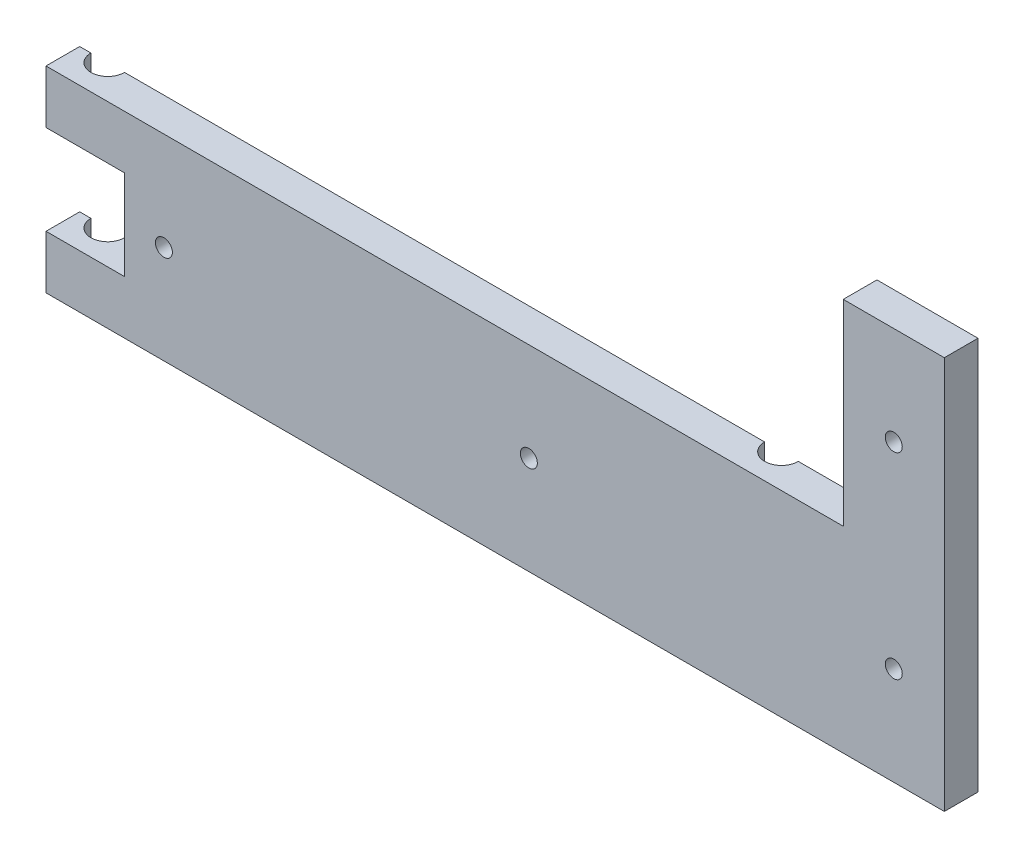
ISO-10303-21;
HEADER;
FILE_DESCRIPTION(('STEP AP214'),'2;1');
FILE_NAME('part.step','',(''),(''),'','','');
FILE_SCHEMA(('AUTOMOTIVE_DESIGN { 1 0 10303 214 1 1 1 1 }'));
ENDSEC;
DATA;
#1=APPLICATION_CONTEXT('core data for automotive mechanical design processes');
#2=APPLICATION_PROTOCOL_DEFINITION('international standard','automotive_design',2000,#1);
#3=PRODUCT_CONTEXT('',#1,'mechanical');
#4=PRODUCT('Part','Part','',(#3));
#5=PRODUCT_RELATED_PRODUCT_CATEGORY('part','',(#4));
#6=PRODUCT_DEFINITION_FORMATION('','',#4);
#7=PRODUCT_DEFINITION_CONTEXT('part definition',#1,'design');
#8=PRODUCT_DEFINITION('design','',#6,#7);
#9=PRODUCT_DEFINITION_SHAPE('','',#8);
#10=(LENGTH_UNIT() NAMED_UNIT(*) SI_UNIT(.MILLI.,.METRE.));
#11=(NAMED_UNIT(*) PLANE_ANGLE_UNIT() SI_UNIT($,.RADIAN.));
#12=(NAMED_UNIT(*) SI_UNIT($,.STERADIAN.) SOLID_ANGLE_UNIT());
#13=UNCERTAINTY_MEASURE_WITH_UNIT(LENGTH_MEASURE(1.E-05),#10,'distance_accuracy_value','');
#14=(GEOMETRIC_REPRESENTATION_CONTEXT(3) GLOBAL_UNCERTAINTY_ASSIGNED_CONTEXT((#13)) GLOBAL_UNIT_ASSIGNED_CONTEXT((#10,
#11,#12)) REPRESENTATION_CONTEXT('',''));
#15=CARTESIAN_POINT('',(0.,0.,0.));
#16=DIRECTION('',(0.,0.,1.));
#17=DIRECTION('',(1.,0.,0.));
#18=AXIS2_PLACEMENT_3D('',#15,#16,#17);
#19=CARTESIAN_POINT('',(155.,35.,0.));
#20=DIRECTION('',(0.,0.,1.));
#21=DIRECTION('',(1.,0.,0.));
#22=AXIS2_PLACEMENT_3D('',#19,#20,#21);
#23=PLANE('',#22);
#24=CARTESIAN_POINT('',(16.,17.4999999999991,0.));
#25=DIRECTION('',(0.,0.,1.));
#26=DIRECTION('',(1.,0.,0.));
#27=AXIS2_PLACEMENT_3D('',#24,#25,#26);
#28=CIRCLE('',#27,1.51000000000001);
#29=CARTESIAN_POINT('',(17.51,17.4999999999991,0.));
#30=VERTEX_POINT('',#29);
#31=EDGE_CURVE('E292',#30,#30,#28,.T.);
#32=ORIENTED_EDGE('',*,*,#31,.T.);
#33=EDGE_LOOP('',(#32));
#34=FACE_BOUND('',#33,.T.);
#35=CARTESIAN_POINT('',(81.,17.4999999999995,0.));
#36=DIRECTION('',(0.,0.,1.));
#37=DIRECTION('',(1.,0.,0.));
#38=AXIS2_PLACEMENT_3D('',#35,#36,#37);
#39=CIRCLE('',#38,1.51000000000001);
#40=CARTESIAN_POINT('',(82.51,17.4999999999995,0.));
#41=VERTEX_POINT('',#40);
#42=EDGE_CURVE('E298',#41,#41,#39,.T.);
#43=ORIENTED_EDGE('',*,*,#42,.T.);
#44=EDGE_LOOP('',(#43));
#45=FACE_BOUND('',#44,.T.);
#46=DIRECTION('',(-1.,0.,0.));
#47=VECTOR('',#46,1.);
#48=CARTESIAN_POINT('',(137.,35.,0.));
#49=LINE('',#48,#47);
#50=CARTESIAN_POINT('',(117.,35.,0.));
#51=VERTEX_POINT('',#50);
#52=CARTESIAN_POINT('',(3.,35.,0.));
#53=VERTEX_POINT('',#52);
#54=EDGE_CURVE('E157',#51,#53,#49,.T.);
#55=ORIENTED_EDGE('',*,*,#54,.F.);
#56=DIRECTION('',(0.,-1.,0.));
#57=VECTOR('',#56,1.);
#58=CARTESIAN_POINT('',(117.,70.,0.));
#59=LINE('',#58,#57);
#60=CARTESIAN_POINT('',(117.,0.,0.));
#61=VERTEX_POINT('',#60);
#62=EDGE_CURVE('E145',#51,#61,#59,.T.);
#63=ORIENTED_EDGE('',*,*,#62,.T.);
#64=DIRECTION('',(1.,0.,0.));
#65=VECTOR('',#64,1.);
#66=CARTESIAN_POINT('',(-4.99999999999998,0.,0.));
#67=LINE('',#66,#65);
#68=CARTESIAN_POINT('',(3.,0.,0.));
#69=VERTEX_POINT('',#68);
#70=EDGE_CURVE('E156',#69,#61,#67,.T.);
#71=ORIENTED_EDGE('',*,*,#70,.F.);
#72=DIRECTION('',(0.,-1.,0.));
#73=VECTOR('',#72,1.);
#74=CARTESIAN_POINT('',(3.,70.,0.));
#75=LINE('',#74,#73);
#76=CARTESIAN_POINT('',(3.,9.50000000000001,0.));
#77=VERTEX_POINT('',#76);
#78=EDGE_CURVE('E278',#69,#77,#75,.F.);
#79=ORIENTED_EDGE('',*,*,#78,.T.);
#80=DIRECTION('',(-1.,0.,0.));
#81=VECTOR('',#80,1.);
#82=CARTESIAN_POINT('',(9.,9.50000000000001,0.));
#83=LINE('',#82,#81);
#84=CARTESIAN_POINT('',(9.,9.50000000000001,0.));
#85=VERTEX_POINT('',#84);
#86=EDGE_CURVE('E246',#85,#77,#83,.T.);
#87=ORIENTED_EDGE('',*,*,#86,.F.);
#88=DIRECTION('',(0.,-1.,0.));
#89=VECTOR('',#88,1.);
#90=CARTESIAN_POINT('',(8.99999999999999,25.5,0.));
#91=LINE('',#90,#89);
#92=CARTESIAN_POINT('',(8.99999999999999,25.5,0.));
#93=VERTEX_POINT('',#92);
#94=EDGE_CURVE('E244',#93,#85,#91,.T.);
#95=ORIENTED_EDGE('',*,*,#94,.F.);
#96=DIRECTION('',(1.,0.,0.));
#97=VECTOR('',#96,1.);
#98=CARTESIAN_POINT('',(-4.99999999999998,25.5,0.));
#99=LINE('',#98,#97);
#100=CARTESIAN_POINT('',(3.,25.5,0.));
#101=VERTEX_POINT('',#100);
#102=EDGE_CURVE('E240',#101,#93,#99,.T.);
#103=ORIENTED_EDGE('',*,*,#102,.F.);
#104=EDGE_CURVE('E54',#101,#53,#75,.F.);
#105=ORIENTED_EDGE('',*,*,#104,.T.);
#106=EDGE_LOOP('',(#55,#63,#71,#79,#87,#95,#103,#105));
#107=FACE_BOUND('',#106,.T.);
#108=ADVANCED_FACE('F31',(#34,#45,#107),#23,.F.);
#109=CARTESIAN_POINT('',(-3.,9.50000000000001,0.));
#110=VERTEX_POINT('',#109);
#111=CARTESIAN_POINT('',(-4.99999999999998,9.5,0.));
#112=VERTEX_POINT('',#111);
#113=EDGE_CURVE('E245',#110,#112,#83,.T.);
#114=ORIENTED_EDGE('',*,*,#113,.F.);
#115=DIRECTION('',(0.,-1.,0.));
#116=VECTOR('',#115,1.);
#117=CARTESIAN_POINT('',(-3.,70.,0.));
#118=LINE('',#117,#116);
#119=CARTESIAN_POINT('',(-3.,0.,0.));
#120=VERTEX_POINT('',#119);
#121=EDGE_CURVE('E265',#110,#120,#118,.T.);
#122=ORIENTED_EDGE('',*,*,#121,.T.);
#123=CARTESIAN_POINT('',(-4.99999999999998,0.,0.));
#124=VERTEX_POINT('',#123);
#125=EDGE_CURVE('E163',#124,#120,#67,.T.);
#126=ORIENTED_EDGE('',*,*,#125,.F.);
#127=DIRECTION('',(0.,-1.,0.));
#128=VECTOR('',#127,1.);
#129=CARTESIAN_POINT('',(-4.99999999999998,9.5,0.));
#130=LINE('',#129,#128);
#131=EDGE_CURVE('E167',#112,#124,#130,.T.);
#132=ORIENTED_EDGE('',*,*,#131,.F.);
#133=EDGE_LOOP('',(#114,#122,#126,#132));
#134=FACE_BOUND('',#133,.T.);
#135=ADVANCED_FACE('F264',(#134),#23,.F.);
#136=CARTESIAN_POINT('',(-3.,35.,0.));
#137=VERTEX_POINT('',#136);
#138=CARTESIAN_POINT('',(-4.99999999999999,35.,0.));
#139=VERTEX_POINT('',#138);
#140=EDGE_CURVE('E231',#137,#139,#49,.T.);
#141=ORIENTED_EDGE('',*,*,#140,.F.);
#142=CARTESIAN_POINT('',(-3.,25.5,0.));
#143=VERTEX_POINT('',#142);
#144=EDGE_CURVE('E283',#137,#143,#118,.T.);
#145=ORIENTED_EDGE('',*,*,#144,.T.);
#146=CARTESIAN_POINT('',(-4.99999999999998,25.5,0.));
#147=VERTEX_POINT('',#146);
#148=EDGE_CURVE('E241',#147,#143,#99,.T.);
#149=ORIENTED_EDGE('',*,*,#148,.F.);
#150=DIRECTION('',(0.,-1.,0.));
#151=VECTOR('',#150,1.);
#152=CARTESIAN_POINT('',(-4.99999999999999,35.,0.));
#153=LINE('',#152,#151);
#154=EDGE_CURVE('E238',#139,#147,#153,.T.);
#155=ORIENTED_EDGE('',*,*,#154,.F.);
#156=EDGE_LOOP('',(#141,#145,#149,#155));
#157=FACE_BOUND('',#156,.T.);
#158=ADVANCED_FACE('F338',(#157),#23,.F.);
#159=CARTESIAN_POINT('',(155.,35.,6.));
#160=DIRECTION('',(0.,0.,1.));
#161=DIRECTION('',(1.,0.,0.));
#162=AXIS2_PLACEMENT_3D('',#159,#160,#161);
#163=PLANE('',#162);
#164=CARTESIAN_POINT('',(81.,17.4999999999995,6.));
#165=DIRECTION('',(0.,0.,1.));
#166=DIRECTION('',(1.,0.,0.));
#167=AXIS2_PLACEMENT_3D('',#164,#165,#166);
#168=CIRCLE('',#167,1.51000000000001);
#169=CARTESIAN_POINT('',(82.51,17.4999999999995,6.));
#170=VERTEX_POINT('',#169);
#171=EDGE_CURVE('E301',#170,#170,#168,.T.);
#172=ORIENTED_EDGE('',*,*,#171,.F.);
#173=EDGE_LOOP('',(#172));
#174=FACE_BOUND('',#173,.T.);
#175=CARTESIAN_POINT('',(146.,17.5,6.));
#176=DIRECTION('',(0.,0.,1.));
#177=DIRECTION('',(1.,0.,0.));
#178=AXIS2_PLACEMENT_3D('',#175,#176,#177);
#179=CIRCLE('',#178,1.51000000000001);
#180=CARTESIAN_POINT('',(147.51,17.5,6.));
#181=VERTEX_POINT('',#180);
#182=EDGE_CURVE('E313',#181,#181,#179,.T.);
#183=ORIENTED_EDGE('',*,*,#182,.F.);
#184=EDGE_LOOP('',(#183));
#185=FACE_BOUND('',#184,.T.);
#186=DIRECTION('',(0.,1.,0.));
#187=VECTOR('',#186,1.);
#188=CARTESIAN_POINT('',(155.,0.,6.));
#189=LINE('',#188,#187);
#190=CARTESIAN_POINT('',(155.,0.,6.));
#191=VERTEX_POINT('',#190);
#192=CARTESIAN_POINT('',(155.,70.,6.));
#193=VERTEX_POINT('',#192);
#194=EDGE_CURVE('E166',#191,#193,#189,.T.);
#195=ORIENTED_EDGE('',*,*,#194,.T.);
#196=DIRECTION('',(-1.,0.,0.));
#197=VECTOR('',#196,1.);
#198=CARTESIAN_POINT('',(155.,70.,6.));
#199=LINE('',#198,#197);
#200=CARTESIAN_POINT('',(137.,70.,6.));
#201=VERTEX_POINT('',#200);
#202=EDGE_CURVE('E173',#193,#201,#199,.T.);
#203=ORIENTED_EDGE('',*,*,#202,.T.);
#204=DIRECTION('',(0.,-1.,0.));
#205=VECTOR('',#204,1.);
#206=CARTESIAN_POINT('',(137.,70.,6.));
#207=LINE('',#206,#205);
#208=CARTESIAN_POINT('',(137.,35.,6.));
#209=VERTEX_POINT('',#208);
#210=EDGE_CURVE('E175',#201,#209,#207,.T.);
#211=ORIENTED_EDGE('',*,*,#210,.T.);
#212=DIRECTION('',(-1.,0.,0.));
#213=VECTOR('',#212,1.);
#214=CARTESIAN_POINT('',(137.,35.,6.));
#215=LINE('',#214,#213);
#216=CARTESIAN_POINT('',(-4.99999999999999,35.,6.));
#217=VERTEX_POINT('',#216);
#218=EDGE_CURVE('E177',#209,#217,#215,.T.);
#219=ORIENTED_EDGE('',*,*,#218,.T.);
#220=DIRECTION('',(0.,-1.,0.));
#221=VECTOR('',#220,1.);
#222=CARTESIAN_POINT('',(-4.99999999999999,35.,6.));
#223=LINE('',#222,#221);
#224=CARTESIAN_POINT('',(-4.99999999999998,25.5,6.));
#225=VERTEX_POINT('',#224);
#226=EDGE_CURVE('E179',#217,#225,#223,.T.);
#227=ORIENTED_EDGE('',*,*,#226,.T.);
#228=DIRECTION('',(1.,0.,0.));
#229=VECTOR('',#228,1.);
#230=CARTESIAN_POINT('',(-4.99999999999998,25.5,6.));
#231=LINE('',#230,#229);
#232=CARTESIAN_POINT('',(8.99999999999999,25.5,6.));
#233=VERTEX_POINT('',#232);
#234=EDGE_CURVE('E181',#225,#233,#231,.T.);
#235=ORIENTED_EDGE('',*,*,#234,.T.);
#236=DIRECTION('',(0.,-1.,0.));
#237=VECTOR('',#236,1.);
#238=CARTESIAN_POINT('',(8.99999999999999,25.5,6.));
#239=LINE('',#238,#237);
#240=CARTESIAN_POINT('',(9.,9.50000000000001,6.));
#241=VERTEX_POINT('',#240);
#242=EDGE_CURVE('E183',#233,#241,#239,.T.);
#243=ORIENTED_EDGE('',*,*,#242,.T.);
#244=DIRECTION('',(-1.,0.,0.));
#245=VECTOR('',#244,1.);
#246=CARTESIAN_POINT('',(9.,9.50000000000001,6.));
#247=LINE('',#246,#245);
#248=CARTESIAN_POINT('',(-4.99999999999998,9.5,6.));
#249=VERTEX_POINT('',#248);
#250=EDGE_CURVE('E185',#241,#249,#247,.T.);
#251=ORIENTED_EDGE('',*,*,#250,.T.);
#252=DIRECTION('',(0.,-1.,0.));
#253=VECTOR('',#252,1.);
#254=CARTESIAN_POINT('',(-4.99999999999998,9.5,6.));
#255=LINE('',#254,#253);
#256=CARTESIAN_POINT('',(-4.99999999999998,0.,6.));
#257=VERTEX_POINT('',#256);
#258=EDGE_CURVE('E187',#249,#257,#255,.T.);
#259=ORIENTED_EDGE('',*,*,#258,.T.);
#260=DIRECTION('',(1.,0.,0.));
#261=VECTOR('',#260,1.);
#262=CARTESIAN_POINT('',(-4.99999999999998,0.,6.));
#263=LINE('',#262,#261);
#264=EDGE_CURVE('E189',#257,#191,#263,.T.);
#265=ORIENTED_EDGE('',*,*,#264,.T.);
#266=EDGE_LOOP('',(#195,#203,#211,#219,#227,#235,#243,#251,#259,#265));
#267=FACE_BOUND('',#266,.T.);
#268=CARTESIAN_POINT('',(146.,52.5,6.));
#269=DIRECTION('',(0.,0.,1.));
#270=DIRECTION('',(1.,0.,0.));
#271=AXIS2_PLACEMENT_3D('',#268,#269,#270);
#272=CIRCLE('',#271,1.51000000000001);
#273=CARTESIAN_POINT('',(147.51,52.5,6.));
#274=VERTEX_POINT('',#273);
#275=EDGE_CURVE('E307',#274,#274,#272,.T.);
#276=ORIENTED_EDGE('',*,*,#275,.F.);
#277=EDGE_LOOP('',(#276));
#278=FACE_BOUND('',#277,.T.);
#279=CARTESIAN_POINT('',(16.,17.4999999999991,6.));
#280=DIRECTION('',(0.,0.,1.));
#281=DIRECTION('',(1.,0.,0.));
#282=AXIS2_PLACEMENT_3D('',#279,#280,#281);
#283=CIRCLE('',#282,1.51000000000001);
#284=CARTESIAN_POINT('',(17.51,17.4999999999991,6.));
#285=VERTEX_POINT('',#284);
#286=EDGE_CURVE('E295',#285,#285,#283,.T.);
#287=ORIENTED_EDGE('',*,*,#286,.F.);
#288=EDGE_LOOP('',(#287));
#289=FACE_BOUND('',#288,.T.);
#290=ADVANCED_FACE('F270',(#174,#185,#267,#278,#289),#163,.T.);
#291=CARTESIAN_POINT('',(146.,17.5,0.));
#292=DIRECTION('',(0.,0.,1.));
#293=DIRECTION('',(1.,0.,0.));
#294=AXIS2_PLACEMENT_3D('',#291,#292,#293);
#295=CIRCLE('',#294,1.51000000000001);
#296=CARTESIAN_POINT('',(147.51,17.5,0.));
#297=VERTEX_POINT('',#296);
#298=EDGE_CURVE('E310',#297,#297,#295,.T.);
#299=ORIENTED_EDGE('',*,*,#298,.T.);
#300=EDGE_LOOP('',(#299));
#301=FACE_BOUND('',#300,.T.);
#302=CARTESIAN_POINT('',(123.,0.,0.));
#303=VERTEX_POINT('',#302);
#304=CARTESIAN_POINT('',(155.,0.,0.));
#305=VERTEX_POINT('',#304);
#306=EDGE_CURVE('E164',#303,#305,#67,.T.);
#307=ORIENTED_EDGE('',*,*,#306,.F.);
#308=DIRECTION('',(0.,-1.,0.));
#309=VECTOR('',#308,1.);
#310=CARTESIAN_POINT('',(123.,70.,0.));
#311=LINE('',#310,#309);
#312=CARTESIAN_POINT('',(123.,35.,0.));
#313=VERTEX_POINT('',#312);
#314=EDGE_CURVE('E46',#303,#313,#311,.F.);
#315=ORIENTED_EDGE('',*,*,#314,.T.);
#316=CARTESIAN_POINT('',(137.,35.,0.));
#317=VERTEX_POINT('',#316);
#318=EDGE_CURVE('E230',#317,#313,#49,.T.);
#319=ORIENTED_EDGE('',*,*,#318,.F.);
#320=DIRECTION('',(0.,-1.,0.));
#321=VECTOR('',#320,1.);
#322=CARTESIAN_POINT('',(137.,70.,0.));
#323=LINE('',#322,#321);
#324=CARTESIAN_POINT('',(137.,70.,0.));
#325=VERTEX_POINT('',#324);
#326=EDGE_CURVE('E221',#325,#317,#323,.T.);
#327=ORIENTED_EDGE('',*,*,#326,.F.);
#328=DIRECTION('',(-1.,0.,0.));
#329=VECTOR('',#328,1.);
#330=CARTESIAN_POINT('',(155.,70.,0.));
#331=LINE('',#330,#329);
#332=CARTESIAN_POINT('',(155.,70.,0.));
#333=VERTEX_POINT('',#332);
#334=EDGE_CURVE('E228',#333,#325,#331,.T.);
#335=ORIENTED_EDGE('',*,*,#334,.F.);
#336=DIRECTION('',(0.,1.,0.));
#337=VECTOR('',#336,1.);
#338=CARTESIAN_POINT('',(155.,0.,0.));
#339=LINE('',#338,#337);
#340=EDGE_CURVE('E234',#305,#333,#339,.T.);
#341=ORIENTED_EDGE('',*,*,#340,.F.);
#342=EDGE_LOOP('',(#307,#315,#319,#327,#335,#341));
#343=FACE_BOUND('',#342,.T.);
#344=CARTESIAN_POINT('',(146.,52.5,0.));
#345=DIRECTION('',(0.,0.,1.));
#346=DIRECTION('',(1.,0.,0.));
#347=AXIS2_PLACEMENT_3D('',#344,#345,#346);
#348=CIRCLE('',#347,1.51000000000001);
#349=CARTESIAN_POINT('',(147.51,52.5,0.));
#350=VERTEX_POINT('',#349);
#351=EDGE_CURVE('E304',#350,#350,#348,.T.);
#352=ORIENTED_EDGE('',*,*,#351,.T.);
#353=EDGE_LOOP('',(#352));
#354=FACE_BOUND('',#353,.T.);
#355=ADVANCED_FACE('F225',(#301,#343,#354),#23,.F.);
#356=CARTESIAN_POINT('',(155.,0.,6.));
#357=DIRECTION('',(-1.,0.,0.));
#358=DIRECTION('',(0.,-1.,0.));
#359=AXIS2_PLACEMENT_3D('',#356,#357,#358);
#360=PLANE('',#359);
#361=ORIENTED_EDGE('',*,*,#340,.T.);
#362=DIRECTION('',(0.,0.,-1.));
#363=VECTOR('',#362,1.);
#364=CARTESIAN_POINT('',(155.,70.,6.));
#365=LINE('',#364,#363);
#366=EDGE_CURVE('E11',#193,#333,#365,.T.);
#367=ORIENTED_EDGE('',*,*,#366,.F.);
#368=ORIENTED_EDGE('',*,*,#194,.F.);
#369=DIRECTION('',(0.,0.,-1.));
#370=VECTOR('',#369,1.);
#371=CARTESIAN_POINT('',(155.,0.,6.));
#372=LINE('',#371,#370);
#373=EDGE_CURVE('E191',#191,#305,#372,.T.);
#374=ORIENTED_EDGE('',*,*,#373,.T.);
#375=EDGE_LOOP('',(#361,#367,#368,#374));
#376=FACE_BOUND('',#375,.T.);
#377=ADVANCED_FACE('F33',(#376),#360,.F.);
#378=CARTESIAN_POINT('',(155.,70.,6.));
#379=DIRECTION('',(0.,-1.,0.));
#380=DIRECTION('',(0.,0.,-1.));
#381=AXIS2_PLACEMENT_3D('',#378,#379,#380);
#382=PLANE('',#381);
#383=ORIENTED_EDGE('',*,*,#334,.T.);
#384=DIRECTION('',(0.,0.,-1.));
#385=VECTOR('',#384,1.);
#386=CARTESIAN_POINT('',(137.,70.,6.));
#387=LINE('',#386,#385);
#388=EDGE_CURVE('E39',#201,#325,#387,.T.);
#389=ORIENTED_EDGE('',*,*,#388,.F.);
#390=ORIENTED_EDGE('',*,*,#202,.F.);
#391=ORIENTED_EDGE('',*,*,#366,.T.);
#392=EDGE_LOOP('',(#383,#389,#390,#391));
#393=FACE_BOUND('',#392,.T.);
#394=ADVANCED_FACE('F324',(#393),#382,.F.);
#395=CARTESIAN_POINT('',(137.,70.,6.));
#396=DIRECTION('',(1.,0.,0.));
#397=DIRECTION('',(0.,1.,0.));
#398=AXIS2_PLACEMENT_3D('',#395,#396,#397);
#399=PLANE('',#398);
#400=ORIENTED_EDGE('',*,*,#326,.T.);
#401=DIRECTION('',(0.,0.,-1.));
#402=VECTOR('',#401,1.);
#403=CARTESIAN_POINT('',(137.,35.,6.));
#404=LINE('',#403,#402);
#405=EDGE_CURVE('E212',#209,#317,#404,.T.);
#406=ORIENTED_EDGE('',*,*,#405,.F.);
#407=ORIENTED_EDGE('',*,*,#210,.F.);
#408=ORIENTED_EDGE('',*,*,#388,.T.);
#409=EDGE_LOOP('',(#400,#406,#407,#408));
#410=FACE_BOUND('',#409,.T.);
#411=ADVANCED_FACE('F219',(#410),#399,.F.);
#412=CARTESIAN_POINT('',(137.,35.,6.));
#413=DIRECTION('',(0.,-1.,0.));
#414=DIRECTION('',(1.,0.,0.));
#415=AXIS2_PLACEMENT_3D('',#412,#413,#414);
#416=PLANE('',#415);
#417=ORIENTED_EDGE('',*,*,#318,.T.);
#418=CARTESIAN_POINT('',(120.,35.,0.));
#419=DIRECTION('',(0.,-1.,0.));
#420=DIRECTION('',(1.,0.,0.));
#421=AXIS2_PLACEMENT_3D('',#418,#419,#420);
#422=CIRCLE('',#421,3.00000000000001);
#423=EDGE_CURVE('E150',#313,#51,#422,.T.);
#424=ORIENTED_EDGE('',*,*,#423,.T.);
#425=ORIENTED_EDGE('',*,*,#54,.T.);
#426=CARTESIAN_POINT('',(0.,35.,0.));
#427=DIRECTION('',(0.,-1.,0.));
#428=DIRECTION('',(1.,0.,0.));
#429=AXIS2_PLACEMENT_3D('',#426,#427,#428);
#430=CIRCLE('',#429,3.);
#431=EDGE_CURVE('E286',#53,#137,#430,.T.);
#432=ORIENTED_EDGE('',*,*,#431,.T.);
#433=ORIENTED_EDGE('',*,*,#140,.T.);
#434=DIRECTION('',(0.,0.,-1.));
#435=VECTOR('',#434,1.);
#436=CARTESIAN_POINT('',(-4.99999999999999,35.,6.));
#437=LINE('',#436,#435);
#438=EDGE_CURVE('E209',#217,#139,#437,.T.);
#439=ORIENTED_EDGE('',*,*,#438,.F.);
#440=ORIENTED_EDGE('',*,*,#218,.F.);
#441=ORIENTED_EDGE('',*,*,#405,.T.);
#442=EDGE_LOOP('',(#417,#424,#425,#432,#433,#439,#440,#441));
#443=FACE_BOUND('',#442,.T.);
#444=ADVANCED_FACE('F319',(#443),#416,.F.);
#445=CARTESIAN_POINT('',(-4.99999999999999,35.,6.));
#446=DIRECTION('',(1.,0.,0.));
#447=DIRECTION('',(0.,1.,0.));
#448=AXIS2_PLACEMENT_3D('',#445,#446,#447);
#449=PLANE('',#448);
#450=ORIENTED_EDGE('',*,*,#154,.T.);
#451=DIRECTION('',(0.,0.,-1.));
#452=VECTOR('',#451,1.);
#453=CARTESIAN_POINT('',(-4.99999999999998,25.5,6.));
#454=LINE('',#453,#452);
#455=EDGE_CURVE('E206',#225,#147,#454,.T.);
#456=ORIENTED_EDGE('',*,*,#455,.F.);
#457=ORIENTED_EDGE('',*,*,#226,.F.);
#458=ORIENTED_EDGE('',*,*,#438,.T.);
#459=EDGE_LOOP('',(#450,#456,#457,#458));
#460=FACE_BOUND('',#459,.T.);
#461=ADVANCED_FACE('F357',(#460),#449,.F.);
#462=CARTESIAN_POINT('',(-4.99999999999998,25.5,6.));
#463=DIRECTION('',(0.,1.,0.));
#464=DIRECTION('',(0.,0.,1.));
#465=AXIS2_PLACEMENT_3D('',#462,#463,#464);
#466=PLANE('',#465);
#467=ORIENTED_EDGE('',*,*,#148,.T.);
#468=CARTESIAN_POINT('',(0.,25.5,0.));
#469=DIRECTION('',(0.,1.,0.));
#470=DIRECTION('',(0.,0.,1.));
#471=AXIS2_PLACEMENT_3D('',#468,#469,#470);
#472=CIRCLE('',#471,3.);
#473=EDGE_CURVE('E281',#143,#101,#472,.T.);
#474=ORIENTED_EDGE('',*,*,#473,.T.);
#475=ORIENTED_EDGE('',*,*,#102,.T.);
#476=DIRECTION('',(0.,0.,-1.));
#477=VECTOR('',#476,1.);
#478=CARTESIAN_POINT('',(8.99999999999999,25.5,6.));
#479=LINE('',#478,#477);
#480=EDGE_CURVE('E203',#233,#93,#479,.T.);
#481=ORIENTED_EDGE('',*,*,#480,.F.);
#482=ORIENTED_EDGE('',*,*,#234,.F.);
#483=ORIENTED_EDGE('',*,*,#455,.T.);
#484=EDGE_LOOP('',(#467,#474,#475,#481,#482,#483));
#485=FACE_BOUND('',#484,.T.);
#486=ADVANCED_FACE('F360',(#485),#466,.F.);
#487=CARTESIAN_POINT('',(8.99999999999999,25.5,6.));
#488=DIRECTION('',(1.,0.,0.));
#489=DIRECTION('',(0.,1.,0.));
#490=AXIS2_PLACEMENT_3D('',#487,#488,#489);
#491=PLANE('',#490);
#492=ORIENTED_EDGE('',*,*,#94,.T.);
#493=DIRECTION('',(0.,0.,-1.));
#494=VECTOR('',#493,1.);
#495=CARTESIAN_POINT('',(9.,9.50000000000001,6.));
#496=LINE('',#495,#494);
#497=EDGE_CURVE('E200',#241,#85,#496,.T.);
#498=ORIENTED_EDGE('',*,*,#497,.F.);
#499=ORIENTED_EDGE('',*,*,#242,.F.);
#500=ORIENTED_EDGE('',*,*,#480,.T.);
#501=EDGE_LOOP('',(#492,#498,#499,#500));
#502=FACE_BOUND('',#501,.T.);
#503=ADVANCED_FACE('F361',(#502),#491,.F.);
#504=CARTESIAN_POINT('',(9.,9.50000000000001,6.));
#505=DIRECTION('',(0.,-1.,0.));
#506=DIRECTION('',(1.,0.,0.));
#507=AXIS2_PLACEMENT_3D('',#504,#505,#506);
#508=PLANE('',#507);
#509=ORIENTED_EDGE('',*,*,#86,.T.);
#510=CARTESIAN_POINT('',(0.,9.50000000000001,0.));
#511=DIRECTION('',(0.,-1.,0.));
#512=DIRECTION('',(1.,0.,0.));
#513=AXIS2_PLACEMENT_3D('',#510,#511,#512);
#514=CIRCLE('',#513,3.);
#515=EDGE_CURVE('E256',#77,#110,#514,.T.);
#516=ORIENTED_EDGE('',*,*,#515,.T.);
#517=ORIENTED_EDGE('',*,*,#113,.T.);
#518=DIRECTION('',(0.,0.,-1.));
#519=VECTOR('',#518,1.);
#520=CARTESIAN_POINT('',(-4.99999999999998,9.5,6.));
#521=LINE('',#520,#519);
#522=EDGE_CURVE('E197',#249,#112,#521,.T.);
#523=ORIENTED_EDGE('',*,*,#522,.F.);
#524=ORIENTED_EDGE('',*,*,#250,.F.);
#525=ORIENTED_EDGE('',*,*,#497,.T.);
#526=EDGE_LOOP('',(#509,#516,#517,#523,#524,#525));
#527=FACE_BOUND('',#526,.T.);
#528=ADVANCED_FACE('F253',(#527),#508,.F.);
#529=CARTESIAN_POINT('',(-4.99999999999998,9.5,6.));
#530=DIRECTION('',(1.,0.,0.));
#531=DIRECTION('',(0.,1.,0.));
#532=AXIS2_PLACEMENT_3D('',#529,#530,#531);
#533=PLANE('',#532);
#534=ORIENTED_EDGE('',*,*,#131,.T.);
#535=DIRECTION('',(0.,0.,-1.));
#536=VECTOR('',#535,1.);
#537=CARTESIAN_POINT('',(-4.99999999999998,0.,6.));
#538=LINE('',#537,#536);
#539=EDGE_CURVE('E194',#257,#124,#538,.T.);
#540=ORIENTED_EDGE('',*,*,#539,.F.);
#541=ORIENTED_EDGE('',*,*,#258,.F.);
#542=ORIENTED_EDGE('',*,*,#522,.T.);
#543=EDGE_LOOP('',(#534,#540,#541,#542));
#544=FACE_BOUND('',#543,.T.);
#545=ADVANCED_FACE('F261',(#544),#533,.F.);
#546=CARTESIAN_POINT('',(-4.99999999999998,0.,6.));
#547=DIRECTION('',(0.,1.,0.));
#548=DIRECTION('',(0.,0.,1.));
#549=AXIS2_PLACEMENT_3D('',#546,#547,#548);
#550=PLANE('',#549);
#551=ORIENTED_EDGE('',*,*,#70,.T.);
#552=CARTESIAN_POINT('',(120.,0.,0.));
#553=DIRECTION('',(0.,-1.,0.));
#554=DIRECTION('',(0.,0.,-1.));
#555=AXIS2_PLACEMENT_3D('',#552,#553,#554);
#556=CIRCLE('',#555,3.00000000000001);
#557=EDGE_CURVE('E142',#303,#61,#556,.T.);
#558=ORIENTED_EDGE('',*,*,#557,.F.);
#559=ORIENTED_EDGE('',*,*,#306,.T.);
#560=ORIENTED_EDGE('',*,*,#373,.F.);
#561=ORIENTED_EDGE('',*,*,#264,.F.);
#562=ORIENTED_EDGE('',*,*,#539,.T.);
#563=ORIENTED_EDGE('',*,*,#125,.T.);
#564=CARTESIAN_POINT('',(0.,0.,0.));
#565=DIRECTION('',(0.,-1.,0.));
#566=DIRECTION('',(0.,0.,-1.));
#567=AXIS2_PLACEMENT_3D('',#564,#565,#566);
#568=CIRCLE('',#567,3.);
#569=EDGE_CURVE('E158',#69,#120,#568,.T.);
#570=ORIENTED_EDGE('',*,*,#569,.F.);
#571=EDGE_LOOP('',(#551,#558,#559,#560,#561,#562,#563,#570));
#572=FACE_BOUND('',#571,.T.);
#573=ADVANCED_FACE('F161',(#572),#550,.F.);
#574=CARTESIAN_POINT('',(146.,17.5,6.));
#575=DIRECTION('',(0.,0.,-1.));
#576=DIRECTION('',(-1.,0.,0.));
#577=AXIS2_PLACEMENT_3D('',#574,#575,#576);
#578=CYLINDRICAL_SURFACE('',#577,1.51000000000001);
#579=ORIENTED_EDGE('',*,*,#182,.T.);
#580=EDGE_LOOP('',(#579));
#581=FACE_BOUND('',#580,.T.);
#582=ORIENTED_EDGE('',*,*,#298,.F.);
#583=EDGE_LOOP('',(#582));
#584=FACE_BOUND('',#583,.T.);
#585=ADVANCED_FACE('F394',(#581,#584),#578,.F.);
#586=CARTESIAN_POINT('',(146.,52.5,6.));
#587=DIRECTION('',(0.,0.,-1.));
#588=DIRECTION('',(-1.,0.,0.));
#589=AXIS2_PLACEMENT_3D('',#586,#587,#588);
#590=CYLINDRICAL_SURFACE('',#589,1.51000000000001);
#591=ORIENTED_EDGE('',*,*,#275,.T.);
#592=EDGE_LOOP('',(#591));
#593=FACE_BOUND('',#592,.T.);
#594=ORIENTED_EDGE('',*,*,#351,.F.);
#595=EDGE_LOOP('',(#594));
#596=FACE_BOUND('',#595,.T.);
#597=ADVANCED_FACE('F424',(#593,#596),#590,.F.);
#598=CARTESIAN_POINT('',(81.,17.4999999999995,6.));
#599=DIRECTION('',(0.,0.,-1.));
#600=DIRECTION('',(-1.,0.,0.));
#601=AXIS2_PLACEMENT_3D('',#598,#599,#600);
#602=CYLINDRICAL_SURFACE('',#601,1.51000000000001);
#603=ORIENTED_EDGE('',*,*,#171,.T.);
#604=EDGE_LOOP('',(#603));
#605=FACE_BOUND('',#604,.T.);
#606=ORIENTED_EDGE('',*,*,#42,.F.);
#607=EDGE_LOOP('',(#606));
#608=FACE_BOUND('',#607,.T.);
#609=ADVANCED_FACE('F420',(#605,#608),#602,.F.);
#610=CARTESIAN_POINT('',(16.,17.4999999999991,6.));
#611=DIRECTION('',(0.,0.,-1.));
#612=DIRECTION('',(-1.,0.,0.));
#613=AXIS2_PLACEMENT_3D('',#610,#611,#612);
#614=CYLINDRICAL_SURFACE('',#613,1.51000000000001);
#615=ORIENTED_EDGE('',*,*,#286,.T.);
#616=EDGE_LOOP('',(#615));
#617=FACE_BOUND('',#616,.T.);
#618=ORIENTED_EDGE('',*,*,#31,.F.);
#619=EDGE_LOOP('',(#618));
#620=FACE_BOUND('',#619,.T.);
#621=ADVANCED_FACE('F404',(#617,#620),#614,.F.);
#622=CARTESIAN_POINT('',(0.,70.,0.));
#623=DIRECTION('',(0.,-1.,0.));
#624=DIRECTION('',(0.,0.,-1.));
#625=AXIS2_PLACEMENT_3D('',#622,#623,#624);
#626=CYLINDRICAL_SURFACE('',#625,3.);
#627=ORIENTED_EDGE('',*,*,#515,.F.);
#628=ORIENTED_EDGE('',*,*,#78,.F.);
#629=ORIENTED_EDGE('',*,*,#569,.T.);
#630=ORIENTED_EDGE('',*,*,#121,.F.);
#631=EDGE_LOOP('',(#627,#628,#629,#630));
#632=FACE_BOUND('',#631,.T.);
#633=ADVANCED_FACE('F399',(#632),#626,.F.);
#634=ORIENTED_EDGE('',*,*,#104,.F.);
#635=ORIENTED_EDGE('',*,*,#473,.F.);
#636=ORIENTED_EDGE('',*,*,#144,.F.);
#637=ORIENTED_EDGE('',*,*,#431,.F.);
#638=EDGE_LOOP('',(#634,#635,#636,#637));
#639=FACE_BOUND('',#638,.T.);
#640=ADVANCED_FACE('F403',(#639),#626,.F.);
#641=CARTESIAN_POINT('',(120.,70.,0.));
#642=DIRECTION('',(0.,-1.,0.));
#643=DIRECTION('',(0.,0.,-1.));
#644=AXIS2_PLACEMENT_3D('',#641,#642,#643);
#645=CYLINDRICAL_SURFACE('',#644,3.00000000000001);
#646=ORIENTED_EDGE('',*,*,#423,.F.);
#647=ORIENTED_EDGE('',*,*,#314,.F.);
#648=ORIENTED_EDGE('',*,*,#557,.T.);
#649=ORIENTED_EDGE('',*,*,#62,.F.);
#650=EDGE_LOOP('',(#646,#647,#648,#649));
#651=FACE_BOUND('',#650,.T.);
#652=ADVANCED_FACE('F144',(#651),#645,.F.);
#653=CLOSED_SHELL('',(#108,#135,#158,#290,#355,#377,#394,#411,#444,#461,#486,#503,#528,#545,
#573,#585,#597,#609,#621,#633,#640,#652));
#654=MANIFOLD_SOLID_BREP('B2',#653);
#655=ADVANCED_BREP_SHAPE_REPRESENTATION('',(#18,#654),#14);
#656=SHAPE_DEFINITION_REPRESENTATION(#9,#655);
ENDSEC;
END-ISO-10303-21;
